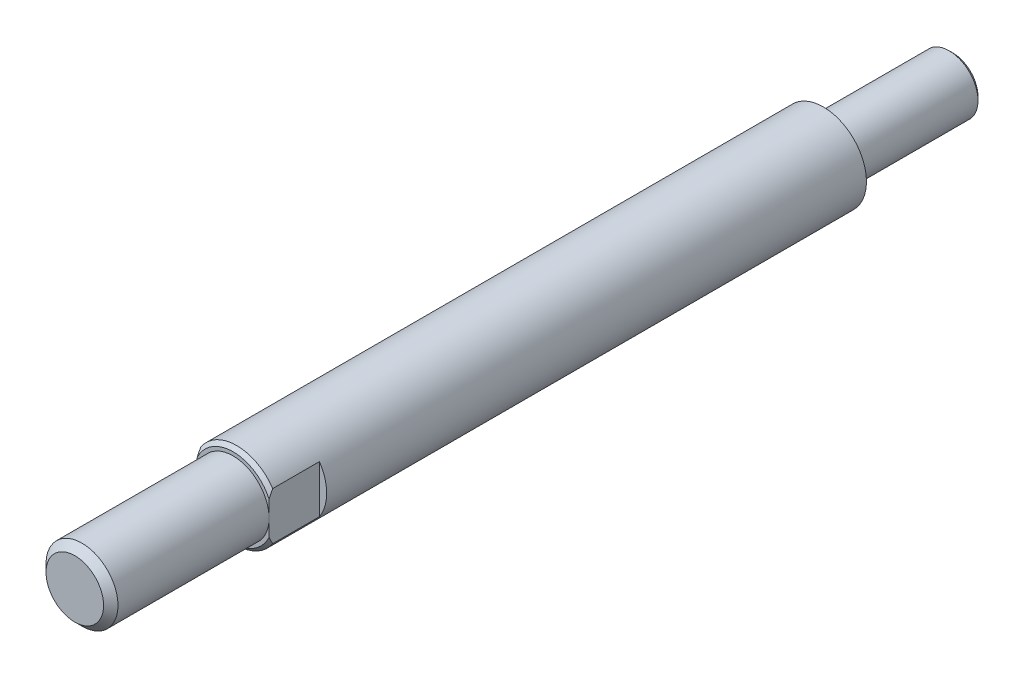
ISO-10303-21;
HEADER;
FILE_DESCRIPTION(('STEP AP214'),'2;1');
FILE_NAME('part.step','',(''),(''),'','','');
FILE_SCHEMA(('AUTOMOTIVE_DESIGN { 1 0 10303 214 1 1 1 1 }'));
ENDSEC;
DATA;
#1=APPLICATION_CONTEXT('core data for automotive mechanical design processes');
#2=APPLICATION_PROTOCOL_DEFINITION('international standard','automotive_design',2000,#1);
#3=PRODUCT_CONTEXT('',#1,'mechanical');
#4=PRODUCT('Part','Part','',(#3));
#5=PRODUCT_RELATED_PRODUCT_CATEGORY('part','',(#4));
#6=PRODUCT_DEFINITION_FORMATION('','',#4);
#7=PRODUCT_DEFINITION_CONTEXT('part definition',#1,'design');
#8=PRODUCT_DEFINITION('design','',#6,#7);
#9=PRODUCT_DEFINITION_SHAPE('','',#8);
#10=(LENGTH_UNIT() NAMED_UNIT(*) SI_UNIT(.MILLI.,.METRE.));
#11=(NAMED_UNIT(*) PLANE_ANGLE_UNIT() SI_UNIT($,.RADIAN.));
#12=(NAMED_UNIT(*) SI_UNIT($,.STERADIAN.) SOLID_ANGLE_UNIT());
#13=UNCERTAINTY_MEASURE_WITH_UNIT(LENGTH_MEASURE(1.E-05),#10,'distance_accuracy_value','');
#14=(GEOMETRIC_REPRESENTATION_CONTEXT(3) GLOBAL_UNCERTAINTY_ASSIGNED_CONTEXT((#13)) GLOBAL_UNIT_ASSIGNED_CONTEXT((#10,
#11,#12)) REPRESENTATION_CONTEXT('',''));
#15=CARTESIAN_POINT('',(0.,0.,0.));
#16=DIRECTION('',(0.,0.,1.));
#17=DIRECTION('',(1.,0.,0.));
#18=AXIS2_PLACEMENT_3D('',#15,#16,#17);
#19=CARTESIAN_POINT('',(0.,0.,122.));
#20=DIRECTION('',(0.,0.,-1.));
#21=DIRECTION('',(-1.,0.,0.));
#22=AXIS2_PLACEMENT_3D('',#19,#20,#21);
#23=CYLINDRICAL_SURFACE('',#22,6.);
#24=CARTESIAN_POINT('',(0.,0.,18.));
#25=DIRECTION('',(0.,0.,-1.));
#26=DIRECTION('',(-1.,0.,0.));
#27=AXIS2_PLACEMENT_3D('',#24,#25,#26);
#28=CIRCLE('',#27,6.);
#29=CARTESIAN_POINT('',(-6.,0.,18.));
#30=VERTEX_POINT('',#29);
#31=EDGE_CURVE('E141',#30,#30,#28,.T.);
#32=ORIENTED_EDGE('',*,*,#31,.F.);
#33=EDGE_LOOP('',(#32));
#34=FACE_BOUND('',#33,.T.);
#35=DIRECTION('',(0.,0.,-1.));
#36=VECTOR('',#35,1.);
#37=CARTESIAN_POINT('',(-5.,3.3166247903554,122.));
#38=LINE('',#37,#36);
#39=CARTESIAN_POINT('',(-5.,3.3166247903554,99.5000000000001));
#40=VERTEX_POINT('',#39);
#41=CARTESIAN_POINT('',(-5.,3.3166247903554,93.));
#42=VERTEX_POINT('',#41);
#43=EDGE_CURVE('E122',#40,#42,#38,.T.);
#44=ORIENTED_EDGE('',*,*,#43,.F.);
#45=CARTESIAN_POINT('',(0.,0.,99.5000000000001));
#46=DIRECTION('',(0.,0.,1.));
#47=DIRECTION('',(1.,0.,0.));
#48=AXIS2_PLACEMENT_3D('',#45,#46,#47);
#49=CIRCLE('',#48,6.);
#50=CARTESIAN_POINT('',(5.,3.3166247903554,99.5000000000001));
#51=VERTEX_POINT('',#50);
#52=EDGE_CURVE('E163',#40,#51,#49,.F.);
#53=ORIENTED_EDGE('',*,*,#52,.T.);
#54=DIRECTION('',(0.,0.,-1.));
#55=VECTOR('',#54,1.);
#56=CARTESIAN_POINT('',(5.,3.3166247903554,122.));
#57=LINE('',#56,#55);
#58=CARTESIAN_POINT('',(5.,3.3166247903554,93.));
#59=VERTEX_POINT('',#58);
#60=EDGE_CURVE('E135',#51,#59,#57,.T.);
#61=ORIENTED_EDGE('',*,*,#60,.T.);
#62=CARTESIAN_POINT('',(0.,0.,93.));
#63=DIRECTION('',(0.,0.,-1.));
#64=DIRECTION('',(-1.,0.,0.));
#65=AXIS2_PLACEMENT_3D('',#62,#63,#64);
#66=CIRCLE('',#65,6.);
#67=CARTESIAN_POINT('',(5.,-3.3166247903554,93.));
#68=VERTEX_POINT('',#67);
#69=EDGE_CURVE('E175',#59,#68,#66,.T.);
#70=ORIENTED_EDGE('',*,*,#69,.T.);
#71=DIRECTION('',(0.,0.,-1.));
#72=VECTOR('',#71,1.);
#73=CARTESIAN_POINT('',(5.,-3.3166247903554,122.));
#74=LINE('',#73,#72);
#75=CARTESIAN_POINT('',(5.,-3.3166247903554,99.5000000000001));
#76=VERTEX_POINT('',#75);
#77=EDGE_CURVE('E132',#68,#76,#74,.F.);
#78=ORIENTED_EDGE('',*,*,#77,.T.);
#79=CARTESIAN_POINT('',(-5.,-3.3166247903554,99.5000000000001));
#80=VERTEX_POINT('',#79);
#81=EDGE_CURVE('E164',#76,#80,#49,.F.);
#82=ORIENTED_EDGE('',*,*,#81,.T.);
#83=DIRECTION('',(0.,0.,-1.));
#84=VECTOR('',#83,1.);
#85=CARTESIAN_POINT('',(-5.,-3.3166247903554,122.));
#86=LINE('',#85,#84);
#87=CARTESIAN_POINT('',(-5.,-3.3166247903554,93.));
#88=VERTEX_POINT('',#87);
#89=EDGE_CURVE('E51',#88,#80,#86,.F.);
#90=ORIENTED_EDGE('',*,*,#89,.F.);
#91=CARTESIAN_POINT('',(0.,0.,93.));
#92=DIRECTION('',(0.,0.,1.));
#93=DIRECTION('',(1.,0.,0.));
#94=AXIS2_PLACEMENT_3D('',#91,#92,#93);
#95=CIRCLE('',#94,6.);
#96=EDGE_CURVE('E12',#42,#88,#95,.T.);
#97=ORIENTED_EDGE('',*,*,#96,.F.);
#98=EDGE_LOOP('',(#44,#53,#61,#70,#78,#82,#90,#97));
#99=FACE_BOUND('',#98,.T.);
#100=ADVANCED_FACE('F37',(#34,#99),#23,.T.);
#101=CARTESIAN_POINT('',(0.,0.,100.));
#102=DIRECTION('',(0.,0.,1.));
#103=DIRECTION('',(1.,0.,0.));
#104=AXIS2_PLACEMENT_3D('',#101,#102,#103);
#105=PLANE('',#104);
#106=CARTESIAN_POINT('',(0.,0.,100.));
#107=DIRECTION('',(0.,0.,1.));
#108=DIRECTION('',(1.,0.,0.));
#109=AXIS2_PLACEMENT_3D('',#106,#107,#108);
#110=CIRCLE('',#109,5.50000000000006);
#111=CARTESIAN_POINT('',(5.,2.29128784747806,100.));
#112=VERTEX_POINT('',#111);
#113=CARTESIAN_POINT('',(-5.,2.29128784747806,100.));
#114=VERTEX_POINT('',#113);
#115=EDGE_CURVE('E160',#112,#114,#110,.T.);
#116=ORIENTED_EDGE('',*,*,#115,.T.);
#117=DIRECTION('',(0.,1.,0.));
#118=VECTOR('',#117,1.);
#119=CARTESIAN_POINT('',(-5.,-6.,100.));
#120=LINE('',#119,#118);
#121=CARTESIAN_POINT('',(-5.,0.,100.));
#122=VERTEX_POINT('',#121);
#123=EDGE_CURVE('E115',#122,#114,#120,.T.);
#124=ORIENTED_EDGE('',*,*,#123,.F.);
#125=CARTESIAN_POINT('',(0.,0.,100.));
#126=DIRECTION('',(0.,0.,1.));
#127=DIRECTION('',(1.,0.,0.));
#128=AXIS2_PLACEMENT_3D('',#125,#126,#127);
#129=CIRCLE('',#128,5.);
#130=CARTESIAN_POINT('',(5.,0.,100.));
#131=VERTEX_POINT('',#130);
#132=EDGE_CURVE('E142',#131,#122,#129,.T.);
#133=ORIENTED_EDGE('',*,*,#132,.F.);
#134=DIRECTION('',(0.,1.,0.));
#135=VECTOR('',#134,1.);
#136=CARTESIAN_POINT('',(5.,-6.,100.));
#137=LINE('',#136,#135);
#138=EDGE_CURVE('E126',#131,#112,#137,.T.);
#139=ORIENTED_EDGE('',*,*,#138,.T.);
#140=EDGE_LOOP('',(#116,#124,#133,#139));
#141=FACE_BOUND('',#140,.T.);
#142=ADVANCED_FACE('F200',(#141),#105,.T.);
#143=EDGE_CURVE('E146',#122,#131,#129,.T.);
#144=ORIENTED_EDGE('',*,*,#143,.F.);
#145=CARTESIAN_POINT('',(-5.,-2.29128784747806,100.));
#146=VERTEX_POINT('',#145);
#147=EDGE_CURVE('E119',#146,#122,#120,.T.);
#148=ORIENTED_EDGE('',*,*,#147,.F.);
#149=CARTESIAN_POINT('',(5.,-2.29128784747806,100.));
#150=VERTEX_POINT('',#149);
#151=EDGE_CURVE('E59',#146,#150,#110,.T.);
#152=ORIENTED_EDGE('',*,*,#151,.T.);
#153=EDGE_CURVE('E129',#150,#131,#137,.T.);
#154=ORIENTED_EDGE('',*,*,#153,.T.);
#155=EDGE_LOOP('',(#144,#148,#152,#154));
#156=FACE_BOUND('',#155,.T.);
#157=ADVANCED_FACE('F205',(#156),#105,.T.);
#158=CARTESIAN_POINT('',(0.,0.,100.));
#159=DIRECTION('',(0.,0.,-1.));
#160=DIRECTION('',(-1.,0.,0.));
#161=AXIS2_PLACEMENT_3D('',#158,#159,#160);
#162=CONICAL_SURFACE('',#161,5.50000000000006,0.785398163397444);
#163=ORIENTED_EDGE('',*,*,#52,.F.);
#164=CARTESIAN_POINT('',(-5.,12.2233485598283,92.2935527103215));
#165=CARTESIAN_POINT('',(-5.,12.040002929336,92.4632469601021));
#166=CARTESIAN_POINT('',(-5.,11.8563878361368,92.6326499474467));
#167=CARTESIAN_POINT('',(-5.,11.4885378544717,92.9707842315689));
#168=CARTESIAN_POINT('',(-5.,11.3043029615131,93.1395155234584));
#169=CARTESIAN_POINT('',(-5.,10.7504718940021,93.6446368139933));
#170=CARTESIAN_POINT('',(-5.,10.3798281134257,93.9798811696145));
#171=CARTESIAN_POINT('',(-5.,9.63266719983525,94.6482622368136));
#172=CARTESIAN_POINT('',(-5.,9.2561282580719,94.9813746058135));
#173=CARTESIAN_POINT('',(-5.,8.4981020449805,95.6418569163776));
#174=CARTESIAN_POINT('',(-5.,8.11661535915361,95.9692275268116));
#175=CARTESIAN_POINT('',(-5.,7.42330230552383,96.5513984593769));
#176=CARTESIAN_POINT('',(-5.,7.11271954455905,96.8076769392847));
#177=CARTESIAN_POINT('',(-5.,6.48553211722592,97.3129733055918));
#178=CARTESIAN_POINT('',(-5.,6.16892602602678,97.5619894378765));
#179=CARTESIAN_POINT('',(-5.,5.68812727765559,97.9274135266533));
#180=CARTESIAN_POINT('',(-5.,5.5269667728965,98.0478096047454));
#181=CARTESIAN_POINT('',(-5.,5.2022656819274,98.285342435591));
#182=CARTESIAN_POINT('',(-5.,5.03872520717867,98.4024793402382));
#183=CARTESIAN_POINT('',(-5.,4.70889969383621,98.6327008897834));
#184=CARTESIAN_POINT('',(-5.,4.54261572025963,98.7457870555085));
#185=CARTESIAN_POINT('',(-5.,4.20675664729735,98.9669439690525));
#186=CARTESIAN_POINT('',(-5.,4.03718191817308,99.0750152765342));
#187=CARTESIAN_POINT('',(-5.,3.69809120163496,99.2824200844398));
#188=CARTESIAN_POINT('',(-5.,3.52866368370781,99.3818974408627));
#189=CARTESIAN_POINT('',(-5.,3.18548204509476,99.5731968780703));
#190=CARTESIAN_POINT('',(-5.,3.0117274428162,99.6650181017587));
#191=CARTESIAN_POINT('',(-5.,2.65945234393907,99.8387964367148));
#192=CARTESIAN_POINT('',(-5.,2.48093507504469,99.9207600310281));
#193=CARTESIAN_POINT('',(-5.,2.11863259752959,100.07215031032));
#194=CARTESIAN_POINT('',(-5.,1.93484890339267,100.141580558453));
#195=CARTESIAN_POINT('',(-5.,1.60289228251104,100.251152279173));
#196=CARTESIAN_POINT('',(-5.,1.45574319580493,100.294377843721));
#197=CARTESIAN_POINT('',(-5.,1.15856686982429,100.369538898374));
#198=CARTESIAN_POINT('',(-5.,1.00853999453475,100.401475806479));
#199=CARTESIAN_POINT('',(-5.,0.706783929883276,100.452473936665));
#200=CARTESIAN_POINT('',(-5.,0.55506186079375,100.471576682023));
#201=CARTESIAN_POINT('',(-5.,0.250503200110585,100.496029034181));
#202=CARTESIAN_POINT('',(-5.,0.0976666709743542,100.501379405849));
#203=CARTESIAN_POINT('',(-5.,-0.208244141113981,100.498009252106));
#204=CARTESIAN_POINT('',(-5.,-0.3613180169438,100.489252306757));
#205=CARTESIAN_POINT('',(-5.,-0.666062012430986,100.458110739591));
#206=CARTESIAN_POINT('',(-5.,-0.817732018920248,100.435725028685));
#207=CARTESIAN_POINT('',(-5.,-1.11914220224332,100.378427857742));
#208=CARTESIAN_POINT('',(-5.,-1.26887489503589,100.343477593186));
#209=CARTESIAN_POINT('',(-5.,-1.56532579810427,100.262644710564));
#210=CARTESIAN_POINT('',(-5.,-1.71204388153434,100.216761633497));
#211=CARTESIAN_POINT('',(-5.,-2.01964713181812,100.109661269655));
#212=CARTESIAN_POINT('',(-5.,-2.18011816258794,100.047264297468));
#213=CARTESIAN_POINT('',(-5.,-2.49705485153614,99.9129917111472));
#214=CARTESIAN_POINT('',(-5.,-2.65351926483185,99.8411131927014));
#215=CARTESIAN_POINT('',(-5.,-2.9629500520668,99.6895918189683));
#216=CARTESIAN_POINT('',(-5.,-3.11590988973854,99.6099357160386));
#217=CARTESIAN_POINT('',(-5.,-3.41841318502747,99.4444635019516));
#218=CARTESIAN_POINT('',(-5.,-3.56795707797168,99.3586481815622));
#219=CARTESIAN_POINT('',(-5.,-3.86590244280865,99.1809238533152));
#220=CARTESIAN_POINT('',(-5.,-4.01426634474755,99.0889521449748));
#221=CARTESIAN_POINT('',(-5.,-4.30832123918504,98.9008417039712));
#222=CARTESIAN_POINT('',(-5.,-4.45401216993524,98.8047028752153));
#223=CARTESIAN_POINT('',(-5.,-4.88733363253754,98.5113915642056));
#224=CARTESIAN_POINT('',(-5.,-5.17152122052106,98.3091359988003));
#225=CARTESIAN_POINT('',(-5.,-5.76012033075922,97.8753156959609));
#226=CARTESIAN_POINT('',(-5.,-6.06382929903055,97.6428082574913));
#227=CARTESIAN_POINT('',(-5.,-6.66512501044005,97.1699659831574));
#228=CARTESIAN_POINT('',(-5.,-6.96271095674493,96.9296301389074));
#229=CARTESIAN_POINT('',(-5.,-7.55348793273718,96.4431173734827));
#230=CARTESIAN_POINT('',(-5.,-7.84667488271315,96.1969355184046));
#231=CARTESIAN_POINT('',(-5.,-8.4294712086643,95.7003701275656));
#232=CARTESIAN_POINT('',(-5.,-8.71908050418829,95.4499864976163));
#233=CARTESIAN_POINT('',(-5.,-9.27941208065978,94.9600724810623));
#234=CARTESIAN_POINT('',(-5.,-9.5502866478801,94.7207159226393));
#235=CARTESIAN_POINT('',(-5.,-10.0900218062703,94.2397351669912));
#236=CARTESIAN_POINT('',(-5.,-10.3588823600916,93.9981109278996));
#237=CARTESIAN_POINT('',(-5.,-10.8944553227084,93.5135012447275));
#238=CARTESIAN_POINT('',(-5.,-11.161170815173,93.2705192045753));
#239=CARTESIAN_POINT('',(-5.,-11.6932230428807,92.7830718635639));
#240=CARTESIAN_POINT('',(-5.,-11.9585598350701,92.5386066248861));
#241=CARTESIAN_POINT('',(-5.,-12.2233485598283,92.2935527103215));
#242=B_SPLINE_CURVE_WITH_KNOTS('',3,(#164,#165,#166,#167,#168,#169,#170,#171,#172,#173,#174,
#175,#176,#177,#178,#179,#180,#181,#182,#183,#184,#185,#186,#187,#188,#189,#190,#191,#192,#193,
#194,#195,#196,#197,#198,#199,#200,#201,#202,#203,#204,#205,#206,#207,#208,#209,#210,#211,#212,
#213,#214,#215,#216,#217,#218,#219,#220,#221,#222,#223,#224,#225,#226,#227,#228,#229,#230,#231,
#232,#233,#234,#235,#236,#237,#238,#239,#240,#241),.UNSPECIFIED.,.F.,.F.,(4,2,2,2,2,2,2,2,2,2,2,
2,2,2,2,2,2,2,2,2,2,2,2,2,2,2,2,2,2,2,2,2,2,2,2,2,2,2,4),(0.,0.749469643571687,1.49894473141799,
2.99821723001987,4.50639406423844,6.01439402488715,7.22232482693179,8.43054501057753,
9.03401301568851,9.63745284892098,10.2406636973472,10.8438070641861,11.4330691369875,
12.022397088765,12.6113353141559,13.2001058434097,13.6598288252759,14.1194940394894,
14.5776648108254,15.0358100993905,15.4951400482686,15.9545067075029,16.415304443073,
16.8761215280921,17.3922683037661,17.9085735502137,18.4257740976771,18.9429083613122,
19.4664986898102,19.9901010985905,21.0362232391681,22.1835295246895,23.3309841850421,
24.4794443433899,25.6279302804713,26.712341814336,27.7967734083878,28.879170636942,
29.9615227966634),.UNSPECIFIED.);
#243=EDGE_CURVE('E44',#40,#114,#242,.T.);
#244=ORIENTED_EDGE('',*,*,#243,.T.);
#245=ORIENTED_EDGE('',*,*,#115,.F.);
#246=CARTESIAN_POINT('',(5.,12.2233485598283,92.2935527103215));
#247=CARTESIAN_POINT('',(5.,12.0400029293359,92.4632469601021));
#248=CARTESIAN_POINT('',(5.,11.8563878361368,92.6326499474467));
#249=CARTESIAN_POINT('',(5.,11.4885378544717,92.9707842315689));
#250=CARTESIAN_POINT('',(5.,11.3043029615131,93.1395155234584));
#251=CARTESIAN_POINT('',(5.,10.7504718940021,93.6446368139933));
#252=CARTESIAN_POINT('',(5.,10.3798281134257,93.9798811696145));
#253=CARTESIAN_POINT('',(5.,9.63266719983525,94.6482622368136));
#254=CARTESIAN_POINT('',(5.,9.2561282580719,94.9813746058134));
#255=CARTESIAN_POINT('',(5.,8.4981020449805,95.6418569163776));
#256=CARTESIAN_POINT('',(5.,8.11661535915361,95.9692275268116));
#257=CARTESIAN_POINT('',(5.,7.42330230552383,96.5513984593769));
#258=CARTESIAN_POINT('',(5.,7.11271954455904,96.8076769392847));
#259=CARTESIAN_POINT('',(5.,6.4855321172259,97.3129733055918));
#260=CARTESIAN_POINT('',(5.,6.16892602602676,97.5619894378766));
#261=CARTESIAN_POINT('',(5.,5.68812727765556,97.9274135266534));
#262=CARTESIAN_POINT('',(5.,5.52696677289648,98.0478096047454));
#263=CARTESIAN_POINT('',(5.,5.20226568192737,98.285342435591));
#264=CARTESIAN_POINT('',(5.,5.03872520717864,98.4024793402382));
#265=CARTESIAN_POINT('',(5.,4.70889969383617,98.6327008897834));
#266=CARTESIAN_POINT('',(5.,4.54261572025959,98.7457870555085));
#267=CARTESIAN_POINT('',(5.,4.20675664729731,98.9669439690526));
#268=CARTESIAN_POINT('',(5.,4.03718191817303,99.0750152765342));
#269=CARTESIAN_POINT('',(5.,3.69809120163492,99.2824200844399));
#270=CARTESIAN_POINT('',(5.,3.52866368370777,99.3818974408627));
#271=CARTESIAN_POINT('',(5.,3.18548204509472,99.5731968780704));
#272=CARTESIAN_POINT('',(5.,3.01172744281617,99.6650181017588));
#273=CARTESIAN_POINT('',(5.,2.65945234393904,99.8387964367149));
#274=CARTESIAN_POINT('',(5.,2.48093507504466,99.9207600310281));
#275=CARTESIAN_POINT('',(5.,2.11863259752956,100.07215031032));
#276=CARTESIAN_POINT('',(5.,1.93484890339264,100.141580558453));
#277=CARTESIAN_POINT('',(5.,1.60289228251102,100.251152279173));
#278=CARTESIAN_POINT('',(5.,1.4557431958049,100.294377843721));
#279=CARTESIAN_POINT('',(5.,1.15856686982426,100.369538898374));
#280=CARTESIAN_POINT('',(5.,1.00853999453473,100.401475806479));
#281=CARTESIAN_POINT('',(5.,0.706783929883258,100.452473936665));
#282=CARTESIAN_POINT('',(5.,0.555061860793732,100.471576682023));
#283=CARTESIAN_POINT('',(5.,0.250503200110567,100.496029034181));
#284=CARTESIAN_POINT('',(5.,0.0976666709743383,100.501379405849));
#285=CARTESIAN_POINT('',(5.,-0.208244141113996,100.498009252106));
#286=CARTESIAN_POINT('',(5.,-0.361318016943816,100.489252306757));
#287=CARTESIAN_POINT('',(5.,-0.666062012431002,100.458110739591));
#288=CARTESIAN_POINT('',(5.,-0.817732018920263,100.435725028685));
#289=CARTESIAN_POINT('',(5.,-1.11914220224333,100.378427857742));
#290=CARTESIAN_POINT('',(5.,-1.2688748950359,100.343477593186));
#291=CARTESIAN_POINT('',(5.,-1.56532579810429,100.262644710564));
#292=CARTESIAN_POINT('',(5.,-1.71204388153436,100.216761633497));
#293=CARTESIAN_POINT('',(5.,-2.01964713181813,100.109661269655));
#294=CARTESIAN_POINT('',(5.,-2.18011816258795,100.047264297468));
#295=CARTESIAN_POINT('',(5.,-2.49705485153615,99.9129917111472));
#296=CARTESIAN_POINT('',(5.,-2.65351926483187,99.8411131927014));
#297=CARTESIAN_POINT('',(5.,-2.96295005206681,99.6895918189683));
#298=CARTESIAN_POINT('',(5.,-3.11590988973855,99.6099357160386));
#299=CARTESIAN_POINT('',(5.,-3.41841318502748,99.4444635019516));
#300=CARTESIAN_POINT('',(5.,-3.56795707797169,99.3586481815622));
#301=CARTESIAN_POINT('',(5.,-3.86590244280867,99.1809238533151));
#302=CARTESIAN_POINT('',(5.,-4.01426634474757,99.0889521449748));
#303=CARTESIAN_POINT('',(5.,-4.30832123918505,98.9008417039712));
#304=CARTESIAN_POINT('',(5.,-4.45401216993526,98.8047028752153));
#305=CARTESIAN_POINT('',(5.,-4.88733363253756,98.5113915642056));
#306=CARTESIAN_POINT('',(5.,-5.17152122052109,98.3091359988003));
#307=CARTESIAN_POINT('',(5.,-5.76012033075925,97.8753156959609));
#308=CARTESIAN_POINT('',(5.,-6.06382929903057,97.6428082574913));
#309=CARTESIAN_POINT('',(5.,-6.66512501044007,97.1699659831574));
#310=CARTESIAN_POINT('',(5.,-6.96271095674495,96.9296301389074));
#311=CARTESIAN_POINT('',(5.,-7.55348793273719,96.4431173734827));
#312=CARTESIAN_POINT('',(5.,-7.84667488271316,96.1969355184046));
#313=CARTESIAN_POINT('',(5.,-8.42947120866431,95.7003701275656));
#314=CARTESIAN_POINT('',(5.,-8.7190805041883,95.4499864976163));
#315=CARTESIAN_POINT('',(5.,-9.27941208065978,94.9600724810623));
#316=CARTESIAN_POINT('',(5.,-9.5502866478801,94.7207159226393));
#317=CARTESIAN_POINT('',(5.,-10.0900218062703,94.2397351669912));
#318=CARTESIAN_POINT('',(5.,-10.3588823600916,93.9981109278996));
#319=CARTESIAN_POINT('',(5.,-10.8944553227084,93.5135012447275));
#320=CARTESIAN_POINT('',(5.,-11.161170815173,93.2705192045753));
#321=CARTESIAN_POINT('',(5.,-11.6932230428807,92.7830718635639));
#322=CARTESIAN_POINT('',(5.,-11.9585598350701,92.5386066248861));
#323=CARTESIAN_POINT('',(5.,-12.2233485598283,92.2935527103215));
#324=B_SPLINE_CURVE_WITH_KNOTS('',3,(#246,#247,#248,#249,#250,#251,#252,#253,#254,#255,#256,
#257,#258,#259,#260,#261,#262,#263,#264,#265,#266,#267,#268,#269,#270,#271,#272,#273,#274,#275,
#276,#277,#278,#279,#280,#281,#282,#283,#284,#285,#286,#287,#288,#289,#290,#291,#292,#293,#294,
#295,#296,#297,#298,#299,#300,#301,#302,#303,#304,#305,#306,#307,#308,#309,#310,#311,#312,#313,
#314,#315,#316,#317,#318,#319,#320,#321,#322,#323),.UNSPECIFIED.,.F.,.F.,(4,2,2,2,2,2,2,2,2,2,2,
2,2,2,2,2,2,2,2,2,2,2,2,2,2,2,2,2,2,2,2,2,2,2,2,2,2,2,4),(0.,0.749469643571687,1.49894473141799,
2.99821723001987,4.50639406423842,6.01439402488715,7.2223248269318,8.43054501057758,
9.03401301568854,9.63745284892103,10.2406636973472,10.8438070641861,11.4330691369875,
12.0223970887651,12.611335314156,13.2001058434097,13.659828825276,14.1194940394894,
14.5776648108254,15.0358100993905,15.4951400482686,15.9545067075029,16.415304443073,
16.8761215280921,17.3922683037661,17.9085735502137,18.4257740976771,18.9429083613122,
19.4664986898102,19.9901010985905,21.0362232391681,22.1835295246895,23.3309841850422,
24.4794443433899,25.6279302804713,26.712341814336,27.7967734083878,28.879170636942,
29.9615227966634),.UNSPECIFIED.);
#325=EDGE_CURVE('E174',#51,#112,#324,.T.);
#326=ORIENTED_EDGE('',*,*,#325,.F.);
#327=EDGE_LOOP('',(#163,#244,#245,#326));
#328=FACE_BOUND('',#327,.T.);
#329=ADVANCED_FACE('F176',(#328),#162,.T.);
#330=ORIENTED_EDGE('',*,*,#151,.F.);
#331=EDGE_CURVE('E219',#146,#80,#242,.T.);
#332=ORIENTED_EDGE('',*,*,#331,.T.);
#333=ORIENTED_EDGE('',*,*,#81,.F.);
#334=EDGE_CURVE('E167',#150,#76,#324,.T.);
#335=ORIENTED_EDGE('',*,*,#334,.F.);
#336=EDGE_LOOP('',(#330,#332,#333,#335));
#337=FACE_BOUND('',#336,.T.);
#338=ADVANCED_FACE('F225',(#337),#162,.T.);
#339=CARTESIAN_POINT('',(0.,0.,100.));
#340=DIRECTION('',(0.,0.,1.));
#341=DIRECTION('',(1.,0.,0.));
#342=AXIS2_PLACEMENT_3D('',#339,#340,#341);
#343=CYLINDRICAL_SURFACE('',#342,5.);
#344=CARTESIAN_POINT('',(0.,0.,121.));
#345=DIRECTION('',(0.,0.,1.));
#346=DIRECTION('',(1.,0.,0.));
#347=AXIS2_PLACEMENT_3D('',#344,#345,#346);
#348=CIRCLE('',#347,5.);
#349=CARTESIAN_POINT('',(5.,0.,121.));
#350=VERTEX_POINT('',#349);
#351=EDGE_CURVE('E151',#350,#350,#348,.F.);
#352=ORIENTED_EDGE('',*,*,#351,.T.);
#353=EDGE_LOOP('',(#352));
#354=FACE_BOUND('',#353,.T.);
#355=ORIENTED_EDGE('',*,*,#132,.T.);
#356=ORIENTED_EDGE('',*,*,#143,.T.);
#357=EDGE_LOOP('',(#355,#356));
#358=FACE_BOUND('',#357,.T.);
#359=ADVANCED_FACE('F231',(#354,#358),#343,.T.);
#360=CARTESIAN_POINT('',(0.,0.,122.));
#361=DIRECTION('',(0.,0.,1.));
#362=DIRECTION('',(1.,0.,0.));
#363=AXIS2_PLACEMENT_3D('',#360,#361,#362);
#364=PLANE('',#363);
#365=CARTESIAN_POINT('',(0.,0.,122.));
#366=DIRECTION('',(0.,0.,1.));
#367=DIRECTION('',(1.,0.,0.));
#368=AXIS2_PLACEMENT_3D('',#365,#366,#367);
#369=CIRCLE('',#368,4.);
#370=CARTESIAN_POINT('',(4.,0.,122.));
#371=VERTEX_POINT('',#370);
#372=EDGE_CURVE('E145',#371,#371,#369,.T.);
#373=ORIENTED_EDGE('',*,*,#372,.T.);
#374=EDGE_LOOP('',(#373));
#375=FACE_BOUND('',#374,.T.);
#376=ADVANCED_FACE('F233',(#375),#364,.T.);
#377=CARTESIAN_POINT('',(0.,0.,18.));
#378=DIRECTION('',(0.,0.,-1.));
#379=DIRECTION('',(-1.,0.,0.));
#380=AXIS2_PLACEMENT_3D('',#377,#378,#379);
#381=PLANE('',#380);
#382=CARTESIAN_POINT('',(0.,0.,18.));
#383=DIRECTION('',(0.,0.,-1.));
#384=DIRECTION('',(-1.,0.,0.));
#385=AXIS2_PLACEMENT_3D('',#382,#383,#384);
#386=CIRCLE('',#385,4.);
#387=CARTESIAN_POINT('',(-4.,0.,18.));
#388=VERTEX_POINT('',#387);
#389=EDGE_CURVE('E138',#388,#388,#386,.T.);
#390=ORIENTED_EDGE('',*,*,#389,.F.);
#391=EDGE_LOOP('',(#390));
#392=FACE_BOUND('',#391,.T.);
#393=ORIENTED_EDGE('',*,*,#31,.T.);
#394=EDGE_LOOP('',(#393));
#395=FACE_BOUND('',#394,.T.);
#396=ADVANCED_FACE('F240',(#392,#395),#381,.T.);
#397=CARTESIAN_POINT('',(0.,0.,18.));
#398=DIRECTION('',(0.,0.,-1.));
#399=DIRECTION('',(-1.,0.,0.));
#400=AXIS2_PLACEMENT_3D('',#397,#398,#399);
#401=CYLINDRICAL_SURFACE('',#400,4.);
#402=CARTESIAN_POINT('',(0.,0.,0.500000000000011));
#403=DIRECTION('',(0.,0.,1.));
#404=DIRECTION('',(1.,0.,0.));
#405=AXIS2_PLACEMENT_3D('',#402,#403,#404);
#406=CIRCLE('',#405,4.);
#407=CARTESIAN_POINT('',(4.,0.,0.500000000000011));
#408=VERTEX_POINT('',#407);
#409=EDGE_CURVE('E157',#408,#408,#406,.T.);
#410=ORIENTED_EDGE('',*,*,#409,.T.);
#411=EDGE_LOOP('',(#410));
#412=FACE_BOUND('',#411,.T.);
#413=ORIENTED_EDGE('',*,*,#389,.T.);
#414=EDGE_LOOP('',(#413));
#415=FACE_BOUND('',#414,.T.);
#416=ADVANCED_FACE('F247',(#412,#415),#401,.T.);
#417=CARTESIAN_POINT('',(0.,0.,0.));
#418=DIRECTION('',(0.,0.,1.));
#419=DIRECTION('',(1.,0.,0.));
#420=AXIS2_PLACEMENT_3D('',#417,#418,#419);
#421=PLANE('',#420);
#422=CARTESIAN_POINT('',(0.,0.,0.));
#423=DIRECTION('',(0.,0.,-1.));
#424=DIRECTION('',(-1.,0.,0.));
#425=AXIS2_PLACEMENT_3D('',#422,#423,#424);
#426=CIRCLE('',#425,3.);
#427=CARTESIAN_POINT('',(-3.,0.,0.));
#428=VERTEX_POINT('',#427);
#429=EDGE_CURVE('E110',#428,#428,#426,.T.);
#430=ORIENTED_EDGE('',*,*,#429,.F.);
#431=EDGE_LOOP('',(#430));
#432=FACE_BOUND('',#431,.T.);
#433=CARTESIAN_POINT('',(0.,0.,0.));
#434=DIRECTION('',(0.,0.,1.));
#435=DIRECTION('',(1.,0.,0.));
#436=AXIS2_PLACEMENT_3D('',#433,#434,#435);
#437=CIRCLE('',#436,3.49999999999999);
#438=CARTESIAN_POINT('',(3.49999999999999,0.,0.));
#439=VERTEX_POINT('',#438);
#440=EDGE_CURVE('E154',#439,#439,#437,.F.);
#441=ORIENTED_EDGE('',*,*,#440,.T.);
#442=EDGE_LOOP('',(#441));
#443=FACE_BOUND('',#442,.T.);
#444=ADVANCED_FACE('F245',(#432,#443),#421,.F.);
#445=CARTESIAN_POINT('',(0.,0.,122.));
#446=DIRECTION('',(0.,0.,-1.));
#447=DIRECTION('',(-1.,0.,0.));
#448=AXIS2_PLACEMENT_3D('',#445,#446,#447);
#449=CONICAL_SURFACE('',#448,4.,0.785398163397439);
#450=ORIENTED_EDGE('',*,*,#351,.F.);
#451=EDGE_LOOP('',(#450));
#452=FACE_BOUND('',#451,.T.);
#453=ORIENTED_EDGE('',*,*,#372,.F.);
#454=EDGE_LOOP('',(#453));
#455=FACE_BOUND('',#454,.T.);
#456=ADVANCED_FACE('F196',(#452,#455),#449,.T.);
#457=CARTESIAN_POINT('',(0.,0.,0.));
#458=DIRECTION('',(0.,0.,1.));
#459=DIRECTION('',(1.,0.,0.));
#460=AXIS2_PLACEMENT_3D('',#457,#458,#459);
#461=CONICAL_SURFACE('',#460,3.49999999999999,0.785398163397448);
#462=ORIENTED_EDGE('',*,*,#409,.F.);
#463=EDGE_LOOP('',(#462));
#464=FACE_BOUND('',#463,.T.);
#465=ORIENTED_EDGE('',*,*,#440,.F.);
#466=EDGE_LOOP('',(#465));
#467=FACE_BOUND('',#466,.T.);
#468=ADVANCED_FACE('F191',(#464,#467),#461,.T.);
#469=CARTESIAN_POINT('',(6.,-6.,93.));
#470=DIRECTION('',(0.,0.,-1.));
#471=DIRECTION('',(-1.,0.,0.));
#472=AXIS2_PLACEMENT_3D('',#469,#470,#471);
#473=PLANE('',#472);
#474=DIRECTION('',(0.,1.,0.));
#475=VECTOR('',#474,1.);
#476=CARTESIAN_POINT('',(5.,-6.,93.));
#477=LINE('',#476,#475);
#478=EDGE_CURVE('E125',#68,#59,#477,.T.);
#479=ORIENTED_EDGE('',*,*,#478,.F.);
#480=ORIENTED_EDGE('',*,*,#69,.F.);
#481=EDGE_LOOP('',(#479,#480));
#482=FACE_BOUND('',#481,.T.);
#483=ADVANCED_FACE('F185',(#482),#473,.F.);
#484=CARTESIAN_POINT('',(5.,-6.,100.));
#485=DIRECTION('',(-1.,0.,0.));
#486=DIRECTION('',(0.,0.,1.));
#487=AXIS2_PLACEMENT_3D('',#484,#485,#486);
#488=PLANE('',#487);
#489=ORIENTED_EDGE('',*,*,#325,.T.);
#490=ORIENTED_EDGE('',*,*,#138,.F.);
#491=ORIENTED_EDGE('',*,*,#153,.F.);
#492=ORIENTED_EDGE('',*,*,#334,.T.);
#493=ORIENTED_EDGE('',*,*,#77,.F.);
#494=ORIENTED_EDGE('',*,*,#478,.T.);
#495=ORIENTED_EDGE('',*,*,#60,.F.);
#496=EDGE_LOOP('',(#489,#490,#491,#492,#493,#494,#495));
#497=FACE_BOUND('',#496,.T.);
#498=ADVANCED_FACE('F180',(#497),#488,.F.);
#499=CARTESIAN_POINT('',(-6.,-6.,93.));
#500=DIRECTION('',(0.,0.,1.));
#501=DIRECTION('',(1.,0.,0.));
#502=AXIS2_PLACEMENT_3D('',#499,#500,#501);
#503=PLANE('',#502);
#504=DIRECTION('',(0.,1.,0.));
#505=VECTOR('',#504,1.);
#506=CARTESIAN_POINT('',(-5.,-6.,93.));
#507=LINE('',#506,#505);
#508=EDGE_CURVE('E116',#88,#42,#507,.T.);
#509=ORIENTED_EDGE('',*,*,#508,.T.);
#510=ORIENTED_EDGE('',*,*,#96,.T.);
#511=EDGE_LOOP('',(#509,#510));
#512=FACE_BOUND('',#511,.T.);
#513=ADVANCED_FACE('F184',(#512),#503,.T.);
#514=CARTESIAN_POINT('',(-5.,-6.,100.));
#515=DIRECTION('',(-1.,0.,0.));
#516=DIRECTION('',(0.,0.,1.));
#517=AXIS2_PLACEMENT_3D('',#514,#515,#516);
#518=PLANE('',#517);
#519=ORIENTED_EDGE('',*,*,#43,.T.);
#520=ORIENTED_EDGE('',*,*,#508,.F.);
#521=ORIENTED_EDGE('',*,*,#89,.T.);
#522=ORIENTED_EDGE('',*,*,#331,.F.);
#523=ORIENTED_EDGE('',*,*,#147,.T.);
#524=ORIENTED_EDGE('',*,*,#123,.T.);
#525=ORIENTED_EDGE('',*,*,#243,.F.);
#526=EDGE_LOOP('',(#519,#520,#521,#522,#523,#524,#525));
#527=FACE_BOUND('',#526,.T.);
#528=ADVANCED_FACE('F187',(#527),#518,.T.);
#529=CARTESIAN_POINT('',(0.,0.,0.));
#530=DIRECTION('',(0.,0.,-1.));
#531=DIRECTION('',(-1.,0.,0.));
#532=AXIS2_PLACEMENT_3D('',#529,#530,#531);
#533=CONICAL_SURFACE('',#532,3.,0.785398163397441);
#534=CARTESIAN_POINT('',(0.,0.,0.500000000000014));
#535=DIRECTION('',(0.,0.,-1.));
#536=DIRECTION('',(-1.,0.,0.));
#537=AXIS2_PLACEMENT_3D('',#534,#535,#536);
#538=CIRCLE('',#537,2.49999999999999);
#539=CARTESIAN_POINT('',(-2.49999999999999,0.,0.500000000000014));
#540=VERTEX_POINT('',#539);
#541=EDGE_CURVE('E107',#540,#540,#538,.T.);
#542=ORIENTED_EDGE('',*,*,#541,.F.);
#543=EDGE_LOOP('',(#542));
#544=FACE_BOUND('',#543,.T.);
#545=ORIENTED_EDGE('',*,*,#429,.T.);
#546=EDGE_LOOP('',(#545));
#547=FACE_BOUND('',#546,.T.);
#548=ADVANCED_FACE('F261',(#544,#547),#533,.F.);
#549=CARTESIAN_POINT('',(0.,0.,0.));
#550=DIRECTION('',(0.,0.,-1.));
#551=DIRECTION('',(-1.,0.,0.));
#552=AXIS2_PLACEMENT_3D('',#549,#550,#551);
#553=CYLINDRICAL_SURFACE('',#552,2.49999999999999);
#554=CARTESIAN_POINT('',(0.,0.,20.));
#555=DIRECTION('',(0.,0.,-1.));
#556=DIRECTION('',(-1.,0.,0.));
#557=AXIS2_PLACEMENT_3D('',#554,#555,#556);
#558=CIRCLE('',#557,2.5);
#559=CARTESIAN_POINT('',(-2.5,0.,20.));
#560=VERTEX_POINT('',#559);
#561=EDGE_CURVE('E105',#560,#560,#558,.T.);
#562=ORIENTED_EDGE('',*,*,#561,.F.);
#563=EDGE_LOOP('',(#562));
#564=FACE_BOUND('',#563,.T.);
#565=ORIENTED_EDGE('',*,*,#541,.T.);
#566=EDGE_LOOP('',(#565));
#567=FACE_BOUND('',#566,.T.);
#568=ADVANCED_FACE('F101',(#564,#567),#553,.F.);
#569=CARTESIAN_POINT('',(0.,0.,20.));
#570=DIRECTION('',(0.,0.,-1.));
#571=DIRECTION('',(-1.,0.,0.));
#572=AXIS2_PLACEMENT_3D('',#569,#570,#571);
#573=CONICAL_SURFACE('',#572,2.5,1.02974425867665);
#574=CARTESIAN_POINT('',(0.,0.,21.5021515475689));
#575=VERTEX_POINT('',#574);
#576=VERTEX_LOOP('',#575);
#577=FACE_BOUND('',#576,.T.);
#578=ORIENTED_EDGE('',*,*,#561,.T.);
#579=EDGE_LOOP('',(#578));
#580=FACE_BOUND('',#579,.T.);
#581=ADVANCED_FACE('F98',(#577,#580),#573,.F.);
#582=CLOSED_SHELL('',(#100,#142,#157,#329,#338,#359,#376,#396,#416,#444,#456,#468,#483,#498,
#513,#528,#548,#568,#581));
#583=MANIFOLD_SOLID_BREP('B2',#582);
#584=ADVANCED_BREP_SHAPE_REPRESENTATION('',(#18,#583),#14);
#585=SHAPE_DEFINITION_REPRESENTATION(#9,#584);
ENDSEC;
END-ISO-10303-21;
